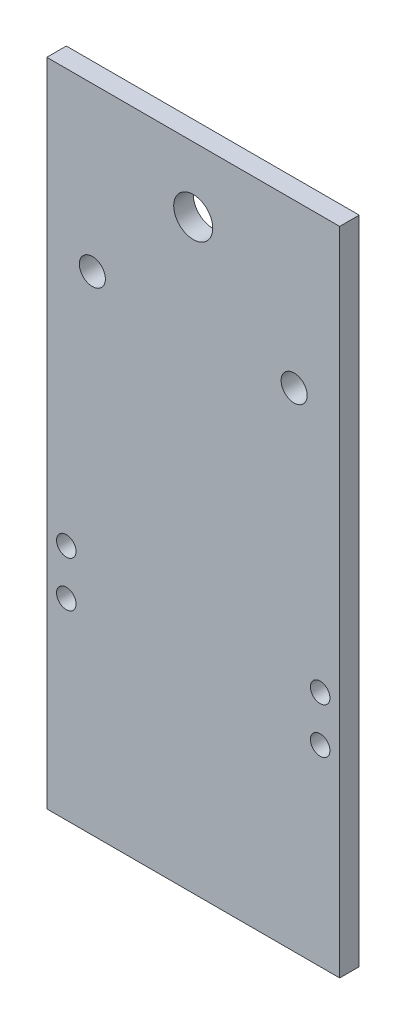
from build123d import *

# Parameters (mm, degrees)
ESQUISSE1_W      = 45
ESQUISSE1_H      = 100
ESQUISSE1_R      = 3
ESQUISSE1_R_2    = 2
ESQUISSE1_R_3    = 1.5
EXTRUSION1_DEPTH = 3


with BuildPart() as part:
    # Esquisse1 → Extrusion1 (new body)
    with BuildSketch(Plane.XY):
        with Locations((-6.95818662, -23.392605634)):
            Rectangle(ESQUISSE1_W, ESQUISSE1_H)
        with Locations((-6.95818662, 16.607394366)):
            Circle(ESQUISSE1_R, mode=Mode.SUBTRACT)
        with Locations((8.54181338, 1.607394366)):
            Circle(ESQUISSE1_R_2, mode=Mode.SUBTRACT)
        with Locations((-22.45818662, 1.607394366)):
            Circle(ESQUISSE1_R_2, mode=Mode.SUBTRACT)
        with Locations((-26.45818662, -43.892605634)):
            Circle(ESQUISSE1_R_3, mode=Mode.SUBTRACT)
        with Locations((12.54181338, -43.892605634)):
            Circle(ESQUISSE1_R_3, mode=Mode.SUBTRACT)
        with Locations((-26.45818662, -36.892605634)):
            Circle(ESQUISSE1_R_3, mode=Mode.SUBTRACT)
        with Locations((12.54181338, -36.892605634)):
            Circle(ESQUISSE1_R_3, mode=Mode.SUBTRACT)
    extrude(amount=EXTRUSION1_DEPTH)


solid = part.part
